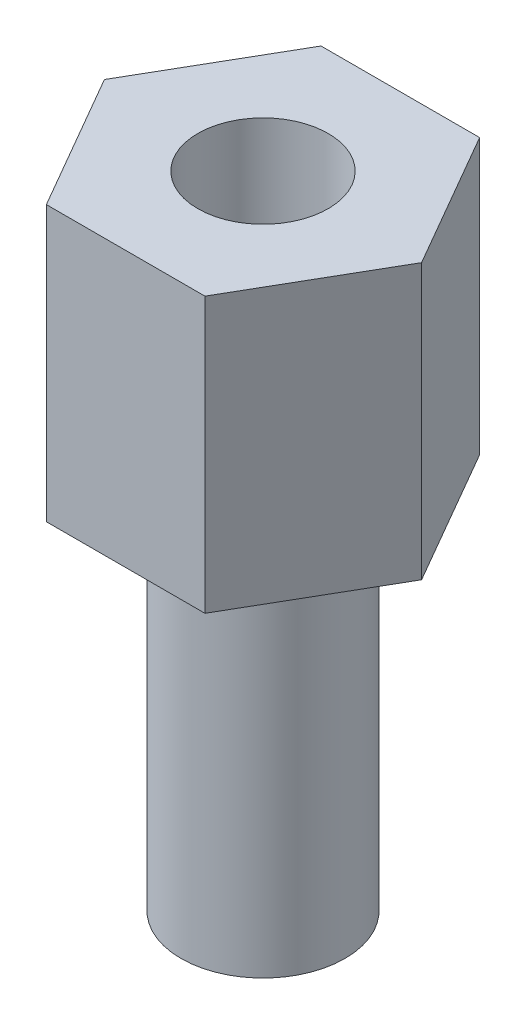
ISO-10303-21;
HEADER;
FILE_DESCRIPTION(('STEP AP214'),'2;1');
FILE_NAME('part.step','',(''),(''),'','','');
FILE_SCHEMA(('AUTOMOTIVE_DESIGN { 1 0 10303 214 1 1 1 1 }'));
ENDSEC;
DATA;
#1=APPLICATION_CONTEXT('core data for automotive mechanical design processes');
#2=APPLICATION_PROTOCOL_DEFINITION('international standard','automotive_design',2000,#1);
#3=PRODUCT_CONTEXT('',#1,'mechanical');
#4=PRODUCT('Part','Part','',(#3));
#5=PRODUCT_RELATED_PRODUCT_CATEGORY('part','',(#4));
#6=PRODUCT_DEFINITION_FORMATION('','',#4);
#7=PRODUCT_DEFINITION_CONTEXT('part definition',#1,'design');
#8=PRODUCT_DEFINITION('design','',#6,#7);
#9=PRODUCT_DEFINITION_SHAPE('','',#8);
#10=(LENGTH_UNIT() NAMED_UNIT(*) SI_UNIT(.MILLI.,.METRE.));
#11=(NAMED_UNIT(*) PLANE_ANGLE_UNIT() SI_UNIT($,.RADIAN.));
#12=(NAMED_UNIT(*) SI_UNIT($,.STERADIAN.) SOLID_ANGLE_UNIT());
#13=UNCERTAINTY_MEASURE_WITH_UNIT(LENGTH_MEASURE(1.E-05),#10,'distance_accuracy_value','');
#14=(GEOMETRIC_REPRESENTATION_CONTEXT(3) GLOBAL_UNCERTAINTY_ASSIGNED_CONTEXT((#13)) GLOBAL_UNIT_ASSIGNED_CONTEXT((#10,
#11,#12)) REPRESENTATION_CONTEXT('',''));
#15=CARTESIAN_POINT('',(0.,0.,0.));
#16=DIRECTION('',(0.,0.,1.));
#17=DIRECTION('',(1.,0.,0.));
#18=AXIS2_PLACEMENT_3D('',#15,#16,#17);
#19=CARTESIAN_POINT('',(2.74963065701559,0.,0.));
#20=DIRECTION('',(0.,1.,0.));
#21=DIRECTION('',(0.,0.,1.));
#22=AXIS2_PLACEMENT_3D('',#19,#20,#21);
#23=PLANE('',#22);
#24=DIRECTION('',(0.5,0.,-0.866025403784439));
#25=VECTOR('',#24,1.);
#26=CARTESIAN_POINT('',(1.37481532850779,0.,2.38125));
#27=LINE('',#26,#25);
#28=CARTESIAN_POINT('',(1.37481532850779,0.,2.38125));
#29=VERTEX_POINT('',#28);
#30=CARTESIAN_POINT('',(2.74963065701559,0.,0.));
#31=VERTEX_POINT('',#30);
#32=EDGE_CURVE('E128',#29,#31,#27,.T.);
#33=ORIENTED_EDGE('',*,*,#32,.F.);
#34=DIRECTION('',(1.,0.,0.));
#35=VECTOR('',#34,1.);
#36=CARTESIAN_POINT('',(-1.3748153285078,0.,2.38125));
#37=LINE('',#36,#35);
#38=CARTESIAN_POINT('',(-1.3748153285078,0.,2.38125));
#39=VERTEX_POINT('',#38);
#40=EDGE_CURVE('E87',#39,#29,#37,.T.);
#41=ORIENTED_EDGE('',*,*,#40,.F.);
#42=DIRECTION('',(0.5,0.,0.866025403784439));
#43=VECTOR('',#42,1.);
#44=CARTESIAN_POINT('',(-2.7496306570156,0.,0.));
#45=LINE('',#44,#43);
#46=CARTESIAN_POINT('',(-2.7496306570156,0.,0.));
#47=VERTEX_POINT('',#46);
#48=EDGE_CURVE('E81',#47,#39,#45,.T.);
#49=ORIENTED_EDGE('',*,*,#48,.F.);
#50=DIRECTION('',(-0.5,0.,0.866025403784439));
#51=VECTOR('',#50,1.);
#52=CARTESIAN_POINT('',(-1.3748153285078,0.,-2.38125000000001));
#53=LINE('',#52,#51);
#54=CARTESIAN_POINT('',(-1.3748153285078,0.,-2.38125000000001));
#55=VERTEX_POINT('',#54);
#56=EDGE_CURVE('E118',#55,#47,#53,.T.);
#57=ORIENTED_EDGE('',*,*,#56,.F.);
#58=DIRECTION('',(-1.,0.,0.));
#59=VECTOR('',#58,1.);
#60=CARTESIAN_POINT('',(1.37481532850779,0.,-2.38125000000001));
#61=LINE('',#60,#59);
#62=CARTESIAN_POINT('',(1.37481532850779,0.,-2.38125000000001));
#63=VERTEX_POINT('',#62);
#64=EDGE_CURVE('E134',#63,#55,#61,.T.);
#65=ORIENTED_EDGE('',*,*,#64,.F.);
#66=DIRECTION('',(-0.5,0.,-0.866025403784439));
#67=VECTOR('',#66,1.);
#68=CARTESIAN_POINT('',(2.74963065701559,0.,0.));
#69=LINE('',#68,#67);
#70=EDGE_CURVE('E131',#31,#63,#69,.T.);
#71=ORIENTED_EDGE('',*,*,#70,.F.);
#72=EDGE_LOOP('',(#33,#41,#49,#57,#65,#71));
#73=FACE_BOUND('',#72,.T.);
#74=CARTESIAN_POINT('',(0.,0.,0.));
#75=DIRECTION('',(0.,1.,0.));
#76=DIRECTION('',(0.,0.,1.));
#77=AXIS2_PLACEMENT_3D('',#74,#75,#76);
#78=CIRCLE('',#77,1.4224);
#79=CARTESIAN_POINT('',(0.,0.,1.4224));
#80=VERTEX_POINT('',#79);
#81=EDGE_CURVE('E11',#80,#80,#78,.F.);
#82=ORIENTED_EDGE('',*,*,#81,.F.);
#83=EDGE_LOOP('',(#82));
#84=FACE_BOUND('',#83,.T.);
#85=ADVANCED_FACE('F40',(#73,#84),#23,.F.);
#86=CARTESIAN_POINT('',(1.37481532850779,4.7625,2.38125));
#87=DIRECTION('',(-0.866025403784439,0.,-0.5));
#88=DIRECTION('',(-0.5,0.,0.866025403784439));
#89=AXIS2_PLACEMENT_3D('',#86,#87,#88);
#90=PLANE('',#89);
#91=ORIENTED_EDGE('',*,*,#32,.T.);
#92=DIRECTION('',(0.,-1.,0.));
#93=VECTOR('',#92,1.);
#94=CARTESIAN_POINT('',(2.74963065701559,4.7625,0.));
#95=LINE('',#94,#93);
#96=CARTESIAN_POINT('',(2.74963065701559,4.7625,0.));
#97=VERTEX_POINT('',#96);
#98=EDGE_CURVE('E49',#97,#31,#95,.T.);
#99=ORIENTED_EDGE('',*,*,#98,.F.);
#100=DIRECTION('',(0.5,0.,-0.866025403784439));
#101=VECTOR('',#100,1.);
#102=CARTESIAN_POINT('',(1.37481532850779,4.7625,2.38125));
#103=LINE('',#102,#101);
#104=CARTESIAN_POINT('',(1.37481532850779,4.7625,2.38125));
#105=VERTEX_POINT('',#104);
#106=EDGE_CURVE('E139',#105,#97,#103,.T.);
#107=ORIENTED_EDGE('',*,*,#106,.F.);
#108=DIRECTION('',(0.,-1.,0.));
#109=VECTOR('',#108,1.);
#110=CARTESIAN_POINT('',(1.37481532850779,4.7625,2.38125));
#111=LINE('',#110,#109);
#112=EDGE_CURVE('E124',#105,#29,#111,.T.);
#113=ORIENTED_EDGE('',*,*,#112,.T.);
#114=EDGE_LOOP('',(#91,#99,#107,#113));
#115=FACE_BOUND('',#114,.T.);
#116=ADVANCED_FACE('F42',(#115),#90,.F.);
#117=CARTESIAN_POINT('',(2.74963065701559,4.7625,0.));
#118=DIRECTION('',(-0.866025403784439,0.,0.5));
#119=DIRECTION('',(0.5,0.,0.866025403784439));
#120=AXIS2_PLACEMENT_3D('',#117,#118,#119);
#121=PLANE('',#120);
#122=ORIENTED_EDGE('',*,*,#70,.T.);
#123=DIRECTION('',(0.,-1.,0.));
#124=VECTOR('',#123,1.);
#125=CARTESIAN_POINT('',(1.37481532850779,4.7625,-2.38125000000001));
#126=LINE('',#125,#124);
#127=CARTESIAN_POINT('',(1.37481532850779,4.7625,-2.38125000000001));
#128=VERTEX_POINT('',#127);
#129=EDGE_CURVE('E143',#128,#63,#126,.T.);
#130=ORIENTED_EDGE('',*,*,#129,.F.);
#131=DIRECTION('',(-0.5,0.,-0.866025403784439));
#132=VECTOR('',#131,1.);
#133=CARTESIAN_POINT('',(2.74963065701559,4.7625,0.));
#134=LINE('',#133,#132);
#135=EDGE_CURVE('E96',#97,#128,#134,.T.);
#136=ORIENTED_EDGE('',*,*,#135,.F.);
#137=ORIENTED_EDGE('',*,*,#98,.T.);
#138=EDGE_LOOP('',(#122,#130,#136,#137));
#139=FACE_BOUND('',#138,.T.);
#140=ADVANCED_FACE('F146',(#139),#121,.F.);
#141=CARTESIAN_POINT('',(1.37481532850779,4.7625,-2.38125000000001));
#142=DIRECTION('',(0.,0.,1.));
#143=DIRECTION('',(1.,0.,0.));
#144=AXIS2_PLACEMENT_3D('',#141,#142,#143);
#145=PLANE('',#144);
#146=ORIENTED_EDGE('',*,*,#64,.T.);
#147=DIRECTION('',(0.,-1.,0.));
#148=VECTOR('',#147,1.);
#149=CARTESIAN_POINT('',(-1.3748153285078,4.7625,-2.38125000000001));
#150=LINE('',#149,#148);
#151=CARTESIAN_POINT('',(-1.3748153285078,4.7625,-2.38125000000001));
#152=VERTEX_POINT('',#151);
#153=EDGE_CURVE('E119',#152,#55,#150,.T.);
#154=ORIENTED_EDGE('',*,*,#153,.F.);
#155=DIRECTION('',(-1.,0.,0.));
#156=VECTOR('',#155,1.);
#157=CARTESIAN_POINT('',(1.37481532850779,4.7625,-2.38125000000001));
#158=LINE('',#157,#156);
#159=EDGE_CURVE('E110',#128,#152,#158,.T.);
#160=ORIENTED_EDGE('',*,*,#159,.F.);
#161=ORIENTED_EDGE('',*,*,#129,.T.);
#162=EDGE_LOOP('',(#146,#154,#160,#161));
#163=FACE_BOUND('',#162,.T.);
#164=ADVANCED_FACE('F154',(#163),#145,.F.);
#165=CARTESIAN_POINT('',(-1.3748153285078,4.7625,-2.38125000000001));
#166=DIRECTION('',(0.866025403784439,0.,0.5));
#167=DIRECTION('',(0.5,0.,-0.866025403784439));
#168=AXIS2_PLACEMENT_3D('',#165,#166,#167);
#169=PLANE('',#168);
#170=ORIENTED_EDGE('',*,*,#56,.T.);
#171=DIRECTION('',(0.,-1.,0.));
#172=VECTOR('',#171,1.);
#173=CARTESIAN_POINT('',(-2.7496306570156,4.7625,0.));
#174=LINE('',#173,#172);
#175=CARTESIAN_POINT('',(-2.7496306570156,4.7625,0.));
#176=VERTEX_POINT('',#175);
#177=EDGE_CURVE('E115',#176,#47,#174,.T.);
#178=ORIENTED_EDGE('',*,*,#177,.F.);
#179=DIRECTION('',(-0.5,0.,0.866025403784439));
#180=VECTOR('',#179,1.);
#181=CARTESIAN_POINT('',(-1.3748153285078,4.7625,-2.38125000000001));
#182=LINE('',#181,#180);
#183=EDGE_CURVE('E104',#152,#176,#182,.T.);
#184=ORIENTED_EDGE('',*,*,#183,.F.);
#185=ORIENTED_EDGE('',*,*,#153,.T.);
#186=EDGE_LOOP('',(#170,#178,#184,#185));
#187=FACE_BOUND('',#186,.T.);
#188=ADVANCED_FACE('F116',(#187),#169,.F.);
#189=CARTESIAN_POINT('',(-2.7496306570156,4.7625,0.));
#190=DIRECTION('',(0.866025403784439,0.,-0.5));
#191=DIRECTION('',(-0.5,0.,-0.866025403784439));
#192=AXIS2_PLACEMENT_3D('',#189,#190,#191);
#193=PLANE('',#192);
#194=ORIENTED_EDGE('',*,*,#48,.T.);
#195=DIRECTION('',(0.,-1.,0.));
#196=VECTOR('',#195,1.);
#197=CARTESIAN_POINT('',(-1.3748153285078,4.7625,2.38125));
#198=LINE('',#197,#196);
#199=CARTESIAN_POINT('',(-1.3748153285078,4.7625,2.38125));
#200=VERTEX_POINT('',#199);
#201=EDGE_CURVE('E120',#200,#39,#198,.T.);
#202=ORIENTED_EDGE('',*,*,#201,.F.);
#203=DIRECTION('',(0.5,0.,0.866025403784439));
#204=VECTOR('',#203,1.);
#205=CARTESIAN_POINT('',(-2.7496306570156,4.7625,0.));
#206=LINE('',#205,#204);
#207=EDGE_CURVE('E108',#176,#200,#206,.T.);
#208=ORIENTED_EDGE('',*,*,#207,.F.);
#209=ORIENTED_EDGE('',*,*,#177,.T.);
#210=EDGE_LOOP('',(#194,#202,#208,#209));
#211=FACE_BOUND('',#210,.T.);
#212=ADVANCED_FACE('F122',(#211),#193,.F.);
#213=CARTESIAN_POINT('',(-1.3748153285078,4.7625,2.38125));
#214=DIRECTION('',(0.,0.,-1.));
#215=DIRECTION('',(-1.,0.,0.));
#216=AXIS2_PLACEMENT_3D('',#213,#214,#215);
#217=PLANE('',#216);
#218=ORIENTED_EDGE('',*,*,#40,.T.);
#219=ORIENTED_EDGE('',*,*,#112,.F.);
#220=DIRECTION('',(1.,0.,0.));
#221=VECTOR('',#220,1.);
#222=CARTESIAN_POINT('',(-1.3748153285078,4.7625,2.38125));
#223=LINE('',#222,#221);
#224=EDGE_CURVE('E57',#200,#105,#223,.T.);
#225=ORIENTED_EDGE('',*,*,#224,.F.);
#226=ORIENTED_EDGE('',*,*,#201,.T.);
#227=EDGE_LOOP('',(#218,#219,#225,#226));
#228=FACE_BOUND('',#227,.T.);
#229=ADVANCED_FACE('F183',(#228),#217,.F.);
#230=CARTESIAN_POINT('',(2.74963065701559,4.7625,0.));
#231=DIRECTION('',(0.,1.,0.));
#232=DIRECTION('',(0.,0.,1.));
#233=AXIS2_PLACEMENT_3D('',#230,#231,#232);
#234=PLANE('',#233);
#235=CARTESIAN_POINT('',(0.,4.7625,0.));
#236=DIRECTION('',(0.,1.,0.));
#237=DIRECTION('',(0.,0.,1.));
#238=AXIS2_PLACEMENT_3D('',#235,#236,#237);
#239=CIRCLE('',#238,1.13029999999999);
#240=CARTESIAN_POINT('',(0.,4.7625,1.13029999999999));
#241=VERTEX_POINT('',#240);
#242=EDGE_CURVE('E160',#241,#241,#239,.T.);
#243=ORIENTED_EDGE('',*,*,#242,.F.);
#244=EDGE_LOOP('',(#243));
#245=FACE_BOUND('',#244,.T.);
#246=ORIENTED_EDGE('',*,*,#106,.T.);
#247=ORIENTED_EDGE('',*,*,#135,.T.);
#248=ORIENTED_EDGE('',*,*,#159,.T.);
#249=ORIENTED_EDGE('',*,*,#183,.T.);
#250=ORIENTED_EDGE('',*,*,#207,.T.);
#251=ORIENTED_EDGE('',*,*,#224,.T.);
#252=EDGE_LOOP('',(#246,#247,#248,#249,#250,#251));
#253=FACE_BOUND('',#252,.T.);
#254=ADVANCED_FACE('F106',(#245,#253),#234,.T.);
#255=CARTESIAN_POINT('',(0.,1.3843,0.));
#256=DIRECTION('',(0.,1.,0.));
#257=DIRECTION('',(0.,0.,1.));
#258=AXIS2_PLACEMENT_3D('',#255,#256,#257);
#259=CONICAL_SURFACE('',#258,1.1303,1.02974425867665);
#260=CARTESIAN_POINT('',(0.,0.705147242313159,0.));
#261=VERTEX_POINT('',#260);
#262=VERTEX_LOOP('',#261);
#263=FACE_BOUND('',#262,.T.);
#264=CARTESIAN_POINT('',(0.,1.3843,0.));
#265=DIRECTION('',(0.,1.,0.));
#266=DIRECTION('',(0.,0.,1.));
#267=AXIS2_PLACEMENT_3D('',#264,#265,#266);
#268=CIRCLE('',#267,1.1303);
#269=CARTESIAN_POINT('',(0.,1.3843,1.1303));
#270=VERTEX_POINT('',#269);
#271=EDGE_CURVE('E132',#270,#270,#268,.T.);
#272=ORIENTED_EDGE('',*,*,#271,.T.);
#273=EDGE_LOOP('',(#272));
#274=FACE_BOUND('',#273,.T.);
#275=ADVANCED_FACE('F218',(#263,#274),#259,.F.);
#276=CARTESIAN_POINT('',(0.,4.7625,0.));
#277=DIRECTION('',(0.,1.,0.));
#278=DIRECTION('',(0.,0.,1.));
#279=AXIS2_PLACEMENT_3D('',#276,#277,#278);
#280=CYLINDRICAL_SURFACE('',#279,1.13029999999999);
#281=ORIENTED_EDGE('',*,*,#271,.F.);
#282=EDGE_LOOP('',(#281));
#283=FACE_BOUND('',#282,.T.);
#284=ORIENTED_EDGE('',*,*,#242,.T.);
#285=EDGE_LOOP('',(#284));
#286=FACE_BOUND('',#285,.T.);
#287=ADVANCED_FACE('F172',(#283,#286),#280,.F.);
#288=CARTESIAN_POINT('',(0.,-6.34999999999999,0.));
#289=DIRECTION('',(0.,1.,0.));
#290=DIRECTION('',(0.,0.,1.));
#291=AXIS2_PLACEMENT_3D('',#288,#289,#290);
#292=CYLINDRICAL_SURFACE('',#291,1.4224);
#293=CARTESIAN_POINT('',(0.,-6.34999999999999,0.));
#294=DIRECTION('',(0.,-1.,0.));
#295=DIRECTION('',(0.,0.,-1.));
#296=AXIS2_PLACEMENT_3D('',#293,#294,#295);
#297=CIRCLE('',#296,1.4224);
#298=CARTESIAN_POINT('',(0.,-6.34999999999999,1.4224));
#299=VERTEX_POINT('',#298);
#300=EDGE_CURVE('E163',#299,#299,#297,.T.);
#301=CARTESIAN_POINT('',(0.,-6.34999999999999,1.4224));
#302=CARTESIAN_POINT('',(0.,-6.28385416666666,1.4224));
#303=CARTESIAN_POINT('',(0.,-6.21770833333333,1.4224));
#304=CARTESIAN_POINT('',(0.,-6.08541666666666,1.4224));
#305=CARTESIAN_POINT('',(0.,-6.01927083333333,1.4224));
#306=CARTESIAN_POINT('',(0.,-5.88697916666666,1.4224));
#307=CARTESIAN_POINT('',(0.,-5.82083333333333,1.4224));
#308=CARTESIAN_POINT('',(0.,-5.68854166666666,1.4224));
#309=CARTESIAN_POINT('',(0.,-5.62239583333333,1.4224));
#310=CARTESIAN_POINT('',(0.,-5.49010416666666,1.4224));
#311=CARTESIAN_POINT('',(0.,-5.42395833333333,1.4224));
#312=CARTESIAN_POINT('',(0.,-5.29166666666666,1.4224));
#313=CARTESIAN_POINT('',(0.,-5.22552083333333,1.4224));
#314=CARTESIAN_POINT('',(0.,-5.09322916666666,1.4224));
#315=CARTESIAN_POINT('',(0.,-5.02708333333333,1.4224));
#316=CARTESIAN_POINT('',(0.,-4.89479166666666,1.4224));
#317=CARTESIAN_POINT('',(0.,-4.82864583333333,1.4224));
#318=CARTESIAN_POINT('',(0.,-4.69635416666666,1.4224));
#319=CARTESIAN_POINT('',(0.,-4.63020833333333,1.4224));
#320=CARTESIAN_POINT('',(0.,-4.49791666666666,1.4224));
#321=CARTESIAN_POINT('',(0.,-4.43177083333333,1.4224));
#322=CARTESIAN_POINT('',(0.,-4.29947916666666,1.4224));
#323=CARTESIAN_POINT('',(0.,-4.23333333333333,1.4224));
#324=CARTESIAN_POINT('',(0.,-4.10104166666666,1.4224));
#325=CARTESIAN_POINT('',(0.,-4.03489583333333,1.4224));
#326=CARTESIAN_POINT('',(0.,-3.90260416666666,1.4224));
#327=CARTESIAN_POINT('',(0.,-3.83645833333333,1.4224));
#328=CARTESIAN_POINT('',(0.,-3.70416666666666,1.4224));
#329=CARTESIAN_POINT('',(0.,-3.63802083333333,1.4224));
#330=CARTESIAN_POINT('',(0.,-3.50572916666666,1.4224));
#331=CARTESIAN_POINT('',(0.,-3.43958333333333,1.4224));
#332=CARTESIAN_POINT('',(0.,-3.30729166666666,1.4224));
#333=CARTESIAN_POINT('',(0.,-3.24114583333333,1.4224));
#334=CARTESIAN_POINT('',(0.,-3.10885416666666,1.4224));
#335=CARTESIAN_POINT('',(0.,-3.04270833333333,1.4224));
#336=CARTESIAN_POINT('',(0.,-2.91041666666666,1.4224));
#337=CARTESIAN_POINT('',(0.,-2.84427083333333,1.4224));
#338=CARTESIAN_POINT('',(0.,-2.71197916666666,1.4224));
#339=CARTESIAN_POINT('',(0.,-2.64583333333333,1.4224));
#340=CARTESIAN_POINT('',(0.,-2.51354166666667,1.4224));
#341=CARTESIAN_POINT('',(0.,-2.44739583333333,1.4224));
#342=CARTESIAN_POINT('',(0.,-2.31510416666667,1.4224));
#343=CARTESIAN_POINT('',(0.,-2.24895833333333,1.4224));
#344=CARTESIAN_POINT('',(0.,-2.11666666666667,1.4224));
#345=CARTESIAN_POINT('',(0.,-2.05052083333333,1.4224));
#346=CARTESIAN_POINT('',(0.,-1.91822916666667,1.4224));
#347=CARTESIAN_POINT('',(0.,-1.85208333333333,1.4224));
#348=CARTESIAN_POINT('',(0.,-1.71979166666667,1.4224));
#349=CARTESIAN_POINT('',(0.,-1.65364583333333,1.4224));
#350=CARTESIAN_POINT('',(0.,-1.52135416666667,1.4224));
#351=CARTESIAN_POINT('',(0.,-1.45520833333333,1.4224));
#352=CARTESIAN_POINT('',(0.,-1.32291666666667,1.4224));
#353=CARTESIAN_POINT('',(0.,-1.25677083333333,1.4224));
#354=CARTESIAN_POINT('',(0.,-1.12447916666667,1.4224));
#355=CARTESIAN_POINT('',(0.,-1.05833333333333,1.4224));
#356=CARTESIAN_POINT('',(0.,-0.926041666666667,1.4224));
#357=CARTESIAN_POINT('',(0.,-0.859895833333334,1.4224));
#358=CARTESIAN_POINT('',(0.,-0.727604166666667,1.4224));
#359=CARTESIAN_POINT('',(0.,-0.661458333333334,1.4224));
#360=CARTESIAN_POINT('',(0.,-0.529166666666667,1.4224));
#361=CARTESIAN_POINT('',(0.,-0.463020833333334,1.4224));
#362=CARTESIAN_POINT('',(0.,-0.330729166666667,1.4224));
#363=CARTESIAN_POINT('',(0.,-0.264583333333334,1.4224));
#364=CARTESIAN_POINT('',(0.,-0.132291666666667,1.4224));
#365=CARTESIAN_POINT('',(0.,-0.0661458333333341,1.4224));
#366=CARTESIAN_POINT('',(0.,0.,1.4224));
#367=B_SPLINE_CURVE_WITH_KNOTS('',3,(#301,#302,#303,#304,#305,#306,#307,#308,#309,#310,#311,
#312,#313,#314,#315,#316,#317,#318,#319,#320,#321,#322,#323,#324,#325,#326,#327,#328,#329,#330,
#331,#332,#333,#334,#335,#336,#337,#338,#339,#340,#341,#342,#343,#344,#345,#346,#347,#348,#349,
#350,#351,#352,#353,#354,#355,#356,#357,#358,#359,#360,#361,#362,#363,#364,#365,#366),
.UNSPECIFIED.,.F.,.F.,(4,2,2,2,2,2,2,2,2,2,2,2,2,2,2,2,2,2,2,2,2,2,2,2,2,2,2,2,2,2,2,2,4),(0.,
0.1984375,0.396875,0.595312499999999,0.793749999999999,0.992187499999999,1.190625,1.3890625,
1.5875,1.7859375,1.984375,2.1828125,2.38125,2.5796875,2.778125,2.9765625,3.175,3.3734375,
3.571875,3.7703125,3.96875,4.1671875,4.365625,4.5640625,4.76249999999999,4.96093749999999,
5.15937499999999,5.35781249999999,5.55624999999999,5.75468749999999,5.95312499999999,
6.15156249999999,6.34999999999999),.UNSPECIFIED.);
#368=EDGE_CURVE('BSEAM169',#299,#80,#367,.T.);
#369=ORIENTED_EDGE('',*,*,#300,.F.);
#370=ORIENTED_EDGE('',*,*,#81,.T.);
#371=ORIENTED_EDGE('',*,*,#368,.T.);
#372=ORIENTED_EDGE('',*,*,#368,.F.);
#373=EDGE_LOOP('',(#369,#371,#370,#372));
#374=FACE_BOUND('',#373,.T.);
#375=ADVANCED_FACE('F169',(#374),#292,.T.);
#376=CARTESIAN_POINT('',(0.,-6.34999999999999,0.));
#377=DIRECTION('',(0.,-1.,0.));
#378=DIRECTION('',(0.,0.,-1.));
#379=AXIS2_PLACEMENT_3D('',#376,#377,#378);
#380=PLANE('',#379);
#381=ORIENTED_EDGE('',*,*,#300,.T.);
#382=EDGE_LOOP('',(#381));
#383=FACE_BOUND('',#382,.T.);
#384=ADVANCED_FACE('F167',(#383),#380,.T.);
#385=CLOSED_SHELL('',(#85,#116,#140,#164,#188,#212,#229,#254,#275,#287,#375,#384));
#386=MANIFOLD_SOLID_BREP('B2',#385);
#387=ADVANCED_BREP_SHAPE_REPRESENTATION('',(#18,#386),#14);
#388=SHAPE_DEFINITION_REPRESENTATION(#9,#387);
ENDSEC;
END-ISO-10303-21;
